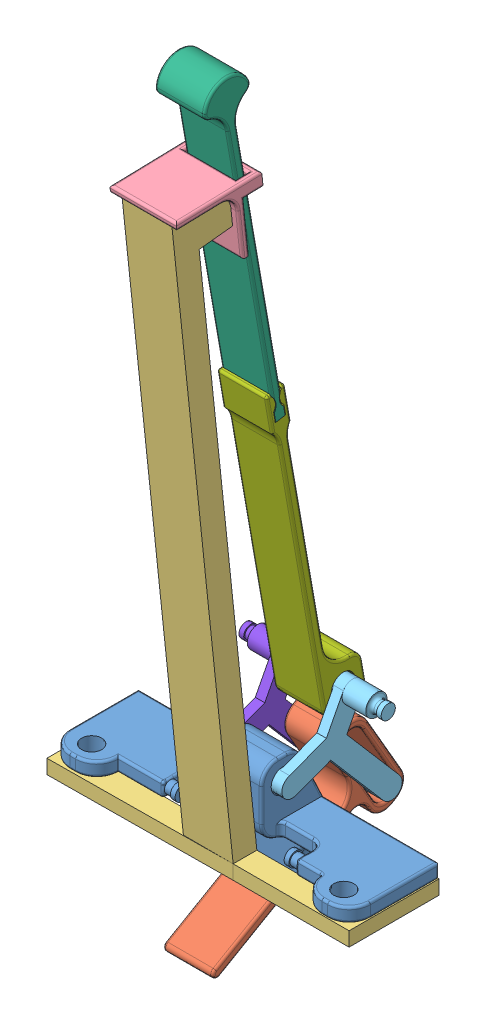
SolidWorks assembly lock with linkage.SLDASM, configuration Default (file format 8000). Lengths in mm.
Overall size (126.8 342.22 105.47).
8 component instances, 8 part files, 26 mates.
Components (placement in the parent):
- base for linkage v3-1: base for linkage v3.SLDPRT [Default] at (35.2255 59.9899 106.2762) size (126.8 53.17 38)
- bolt for linkage v2-1: bolt for linkage v2.SLDPRT [Default] at (38.2255 50.4887 80.0235) x (1 0 0) z (0 -0.5 0.866025) size (21 43 87.15)
- car body-1: car body.SLDPRT [Default] at (28.7255 182.049 125.9687) x (0 0.994522 0.104528) z (1 0 0) size (257.3 39.11 126.8)
- extension mount-1: extension mount.SLDPRT [Default] at (24.7255 306.6314 126.9263) x (0 0.994522 0.104528) z (1 0 0) size (30.04 35.97 28)
- rocker arm v3-1: rocker arm v3.SLDPRT [Default] at (49.7255 86.6012 86.7214) x (0 0.263524 0.964653) z (-1 0 0) size (55.06 46.64 41)
- extension arm v3 lever end-1: extension arm v3 lever end.SLDPRT [Default] at (39.2255 257.1882 111.067) x (0 0.985066 0.172178) z (0 -0.172178 0.985066) size (137.91 21 19.48)
- extension arm v3 link end-2: extension arm v3 link end.SLDPRT [Default] at (39.2255 256.8935 115.0762) x (0 0.985066 0.172178) z (0 0.172178 -0.985066) size (134.11 21 20)
- rocker arm v3 other side-1: rocker arm v3 other side.SLDPRT [Default] at (27.7255 86.6012 86.7214) x (0 0.263524 0.964653) z (-1 0 0) size (55.06 46.64 26)
Mates (geometry in assembly coordinates):
- Coincident1: coincident anti-aligned: plane of base for linkage v3-1 through (27.7255 53.8216 80.2508) normal (0 -0.866025 -0.5); plane of bolt for linkage v2-1 through (27.7255 23.0868 133.485) normal (0 0.866025 0.5)
- Coincident2: coincident anti-aligned: plane of base for linkage v3-1 through (27.7255 53.8216 80.2508) normal (1 0 0); plane of bolt for linkage v2-1 through (27.7255 23.0868 133.485) normal (-1 0 0)
- Coincident3: coincident anti-aligned: plane of base for linkage v3-1 through (35.2255 59.9899 106.2762) normal (0 -1 0); plane of car body-1 through (28.7255 59.9899 125.9687) normal (0 1 0)
- Coincident4: coincident aligned: plane of base for linkage v3-1 through (98.6255 65.9899 87.2762) normal (1 0 0); plane of car body-1 through (98.6255 53.9899 125.2762) normal (1 0 0)
- Coincident5: coincident aligned: plane of base for linkage v3-1 through (-28.1745 65.9899 87.2762) normal (0 0 -1); plane of car body-1 through (98.6255 53.9899 87.2762) normal (0 0 -1)
- Coincident6: coincident anti-aligned: plane of car body-1 through (49.7255 306.6314 126.9263) normal (0 0.104528 -0.994522); plane of extension mount-1 through (52.7255 306.6314 126.9263) normal (0 -0.104528 0.994522)
- Coincident7: coincident anti-aligned: plane of car body-1 through (4.5108 306.6314 126.9263) normal (0 0.999657 0.026177); plane of extension mount-1 through (52.7255 305.9749 151.995) normal (0 -0.999657 -0.026177)
- Coincident8: coincident aligned: plane of base for linkage v3-1 through (52.7255 42.2599 87.2762) normal (1 0 0); plane of extension mount-1 through (52.7255 306.6314 126.9263) normal (1 0 0)
- Coincident9: coincident anti-aligned: plane of extension mount-1 through (49.7255 281.9777 116.3158) normal (0 -0.104528 0.994522); plane of ? through (38.2255 269.288 114.9821) normal (0 0.104528 -0.994522)
- Coincident10: coincident anti-aligned: plane of extension mount-1 through (27.7255 281.9777 116.3158) normal (1 0 0); plane of ? through (27.7255 120.1098 99.3028) normal (-1 0 0)
- Slot1: slot aligned: cylinder of rocker arm v3-1 through (27.7255 58.3105 62.4215) axis (1 0 0) radius 4.5; plane of bolt for linkage v2-1 through (-18.1548 51.9369 64.5152) normal (0 0.5 -0.866025); cylinder of bolt for linkage v2-1 through (-18.1548 77.8196 73.6851) axis (1 0 0) radius 5
- Concentric1: concentric anti-aligned: cylinder of base for linkage v3-1 through (-28.1745 79.9899 104.2468) axis (1 0 0) radius 5; cylinder of rocker arm v3-1 through (53.7255 79.9899 104.2468) axis (-1 0 0) radius 4.5
- Slot2: slot anti-aligned: cylinder of rocker arm v3-1 through (53.7255 111.6729 93.3637) axis (-1 0 0) radius 4.5; plane of ? through (-14.3221 105.7595 101.7918) normal (0 0.994522 0.104528); cylinder of ? through (-14.3221 111.6729 93.3637) axis (1 0 0) radius 5
- Coincident11: coincident anti-aligned: plane of base for linkage v3-1 through (49.7255 88.9899 87.2762) normal (1 0 0); plane of rocker arm v3-1 through (49.7255 86.6012 86.7214) normal (-1 0 0)
- Concentric2: concentric anti-aligned: cylinder of ? through (12.3774 231.9978 107.2921) axis (1 0 0) radius 5; cylinder of extension arm v3 lever end-1 through (48.7255 231.9978 107.2921) axis (-1 0 0) radius 5
- Coincident12: coincident aligned: plane of ? through (48.7255 120.1098 99.3028) normal (1 0 0); plane of extension arm v3 lever end-1 through (48.7255 119.693 103.2441) normal (1 0 0)
- Concentric3: concentric anti-aligned: cylinder of ? through (2.2696 111.6817 93.3895) axis (1 0 0) radius 5; cylinder of rocker arm v3-1 through (53.7255 111.6817 93.3895) axis (-1 0 0) radius 4.5
- Coincident14: coincident aligned: plane of base for linkage v3-1 through (49.7255 88.9899 87.2762) normal (1 0 0); plane of extension arm v3 lever end-1 through (49.7255 108.7396 89.1805) normal (1 0 0)
- Coincident15: coincident aligned: plane of extension arm v3 lever end-1 through (49.7255 108.7396 89.1805) normal (1 0 0); plane of extension arm v3 link end-2 through (49.7255 109.8224 85.3092) normal (1 0 0)
- Coincident17: coincident aligned: plane of extension arm v3 lever end-1 through (39.2255 256.4995 115.0073) normal (0 -0.172178 0.985066); plane of extension arm v3 link end-2 through (39.2255 256.8935 115.0762) normal (0 -0.172178 0.985066)
- Concentric4: concentric anti-aligned: cylinder of rocker arm v3-1 through (53.7255 101.8177 78.8342) axis (-1 0 0) radius 4.5; cylinder of extension arm v3 link end-2 through (3.2696 101.8177 78.8342) axis (1 0 0) radius 5
- Coincident18: coincident: line of extension mount-1 through (27.7224 308.7741 124.1443) axis (1 0 0); plane of extension arm v3 lever end-1 through (39.2255 256.4995 115.0073) normal (0 -0.172178 0.985066)
- Concentric5: concentric anti-aligned: cylinder of rocker arm v3-1 through (35.7255 79.9899 104.2468) axis (-1 0 0) radius 3; cylinder of rocker arm v3 other side-1 through (14.9976 79.9899 104.2468) axis (1 0 0) radius 2.8
- Concentric6: concentric anti-aligned: circle of rocker arm v3-1; cylinder of rocker arm v3 other side-1 through (14.9976 101.8177 78.8342) axis (1 0 0) radius 2.8
- Coincident19: coincident anti-aligned: plane of rocker arm v3-1 through (27.7255 101.8177 78.8342) normal (-1 0 0); plane of rocker arm v3 other side-1 through (27.7255 86.6012 86.7214) normal (1 0 0)
- Coincident20: coincident anti-aligned: plane of extension arm v3 lever end-1 through (49.7255 206.426 140.7705) normal (0 -0.985066 -0.172178); plane of extension arm v3 link end-2 through (39.2255 212.2801 107.2782) normal (0 0.985066 0.172178)
